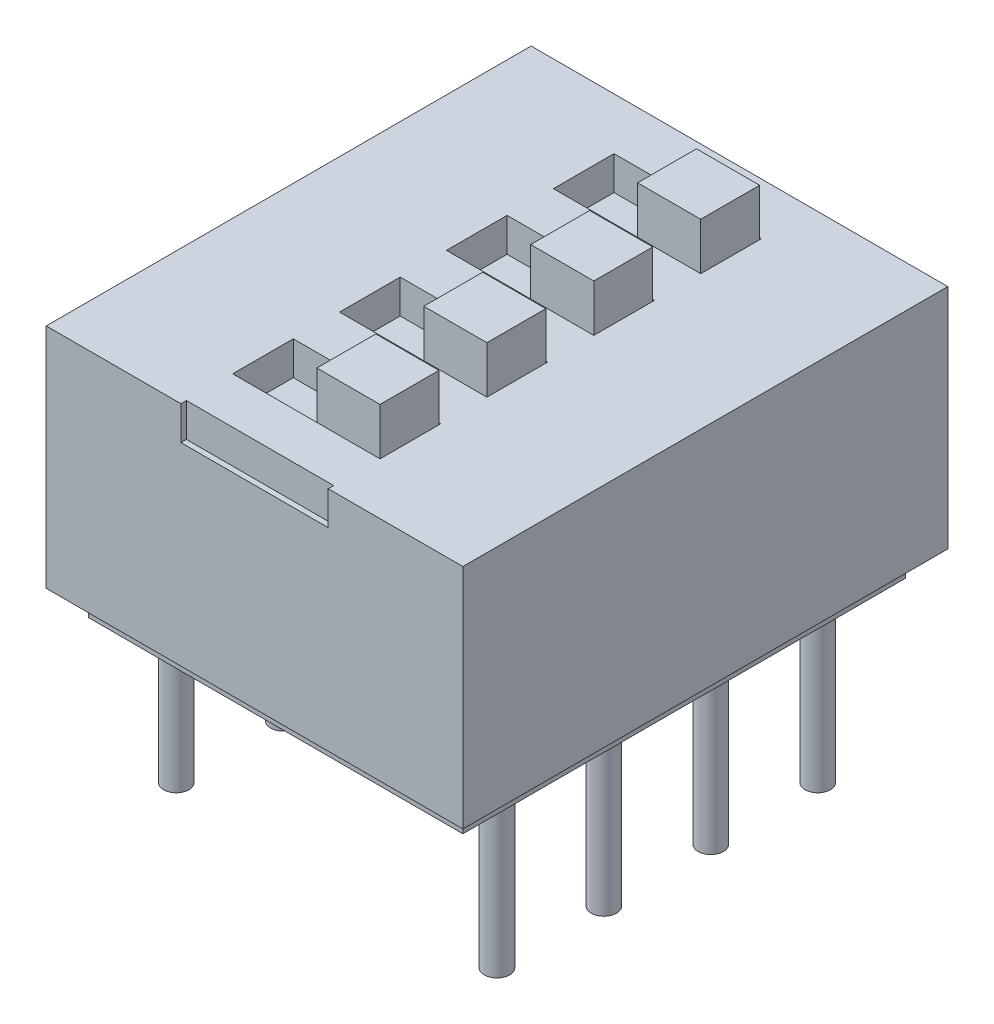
from build123d import *

# Parameters (mm, degrees)
ESQUISSE1_W             = 9.9
ESQUISSE1_H             = 5.4
BOSS_EXTRU_1_DEPTH      = 11.52
ESQUISSE2_W             = 3.5
ESQUISSE2_H             = 1.44
ENL_V_MAT_EXTRU_1_DEPTH = 0.8
ESQUISSE3_W             = 1.5
ESQUISSE3_H             = 1.4
BOSS_EXTRU_2_DEPTH      = 1.9
ESQUISSE4_W             = 8.9
ESQUISSE4_H             = 10.52
BOSS_EXTRU_3_DEPTH      = 0.6
ESQUISSE5_R             = 0.3
BOSS_EXTRU_4_DEPTH      = 3.8


with BuildPart() as part:
    # Esquisse1 → Boss.-Extru.1 (new body)
    with BuildSketch(Plane.XY):
        with Locations((0, 2.7)):
            Rectangle(ESQUISSE1_W, ESQUISSE1_H)
    extrude(amount=BOSS_EXTRU_1_DEPTH)

    # Esquisse2 → Enl_v. mat.-Extru.1 (cut)
    with BuildSketch(Plane(origin=(0, 5.4, 0), x_dir=(1, 0, 0), z_dir=(0, 1, 0))):
        with Locations((0, -4.49)):
            Rectangle(ESQUISSE2_W, ESQUISSE2_H)
        with Locations((0, -1.95)):
            Rectangle(ESQUISSE2_W, ESQUISSE2_H)
        with Locations((0, -7.03)):
            Rectangle(ESQUISSE2_W, ESQUISSE2_H)
        with Locations((0, -9.57)):
            Rectangle(ESQUISSE2_W, ESQUISSE2_H)
        with Locations((0, -12.11)):
            Rectangle(ESQUISSE2_W, ESQUISSE2_H)
    extrude(amount=-ENL_V_MAT_EXTRU_1_DEPTH, mode=Mode.SUBTRACT)

    # Esquisse3 → Boss.-Extru.2 (add)
    with BuildSketch(Plane(origin=(0, 4.6, 0), x_dir=(1, 0, 0), z_dir=(0, 1, 0))):
        with Locations((0.98, -4.49)):
            Rectangle(ESQUISSE3_W, ESQUISSE3_H)
        with Locations((0.98, -1.95)):
            Rectangle(ESQUISSE3_W, ESQUISSE3_H)
        with Locations((0.98, -7.03)):
            Rectangle(ESQUISSE3_W, ESQUISSE3_H)
        with Locations((0.98, -9.57)):
            Rectangle(ESQUISSE3_W, ESQUISSE3_H)
    extrude(amount=BOSS_EXTRU_2_DEPTH)

    # Esquisse4 → Boss.-Extru.3 (add)
    with BuildSketch(Plane.XZ):
        with Locations((0, 5.76)):
            Rectangle(ESQUISSE4_W, ESQUISSE4_H)
    extrude(amount=BOSS_EXTRU_3_DEPTH)

    # Esquisse5 → Boss.-Extru.4 (add)
    with BuildSketch(Plane.XZ.offset(0.6)):
        with Locations(Location((3.81, 1.95, 0), (0, 0, 270))):
            Circle(ESQUISSE5_R)
        with Locations(Location((3.81, 4.49, 0), (0, 0, 270))):
            Circle(ESQUISSE5_R)
        with Locations(Location((3.81, 7.03, 0), (0, 0, 270))):
            Circle(ESQUISSE5_R)
        with Locations(Location((3.81, 9.57, 0), (0, 0, 270))):
            Circle(ESQUISSE5_R)
        with Locations(Location((-3.81, 1.95, 0), (0, 0, 270))):
            Circle(ESQUISSE5_R)
        with Locations(Location((-3.81, 4.49, 0), (0, 0, 270))):
            Circle(ESQUISSE5_R)
        with Locations(Location((-3.81, 7.03, 0), (0, 0, 270))):
            Circle(ESQUISSE5_R)
        with Locations(Location((-3.81, 9.57, 0), (0, 0, 270))):
            Circle(ESQUISSE5_R)
    extrude(amount=BOSS_EXTRU_4_DEPTH)


solid = part.part
